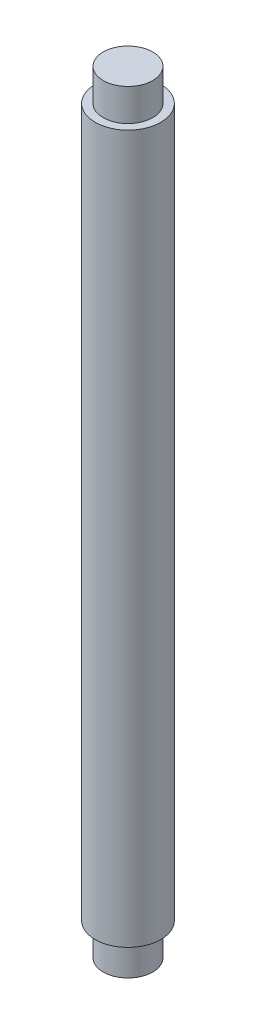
ISO-10303-21;
HEADER;
FILE_DESCRIPTION(('STEP AP214'),'2;1');
FILE_NAME('part.step','',(''),(''),'','','');
FILE_SCHEMA(('AUTOMOTIVE_DESIGN { 1 0 10303 214 1 1 1 1 }'));
ENDSEC;
DATA;
#1=APPLICATION_CONTEXT('core data for automotive mechanical design processes');
#2=APPLICATION_PROTOCOL_DEFINITION('international standard','automotive_design',2000,#1);
#3=PRODUCT_CONTEXT('',#1,'mechanical');
#4=PRODUCT('Part','Part','',(#3));
#5=PRODUCT_RELATED_PRODUCT_CATEGORY('part','',(#4));
#6=PRODUCT_DEFINITION_FORMATION('','',#4);
#7=PRODUCT_DEFINITION_CONTEXT('part definition',#1,'design');
#8=PRODUCT_DEFINITION('design','',#6,#7);
#9=PRODUCT_DEFINITION_SHAPE('','',#8);
#10=(LENGTH_UNIT() NAMED_UNIT(*) SI_UNIT(.MILLI.,.METRE.));
#11=(NAMED_UNIT(*) PLANE_ANGLE_UNIT() SI_UNIT($,.RADIAN.));
#12=(NAMED_UNIT(*) SI_UNIT($,.STERADIAN.) SOLID_ANGLE_UNIT());
#13=UNCERTAINTY_MEASURE_WITH_UNIT(LENGTH_MEASURE(1.E-05),#10,'distance_accuracy_value','');
#14=(GEOMETRIC_REPRESENTATION_CONTEXT(3) GLOBAL_UNCERTAINTY_ASSIGNED_CONTEXT((#13)) GLOBAL_UNIT_ASSIGNED_CONTEXT((#10,
#11,#12)) REPRESENTATION_CONTEXT('',''));
#15=CARTESIAN_POINT('',(0.,0.,0.));
#16=DIRECTION('',(0.,0.,1.));
#17=DIRECTION('',(1.,0.,0.));
#18=AXIS2_PLACEMENT_3D('',#15,#16,#17);
#19=CARTESIAN_POINT('',(-7.23899999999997,-7.11200000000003,0.));
#20=DIRECTION('',(0.,1.,0.));
#21=DIRECTION('',(0.,0.,1.));
#22=AXIS2_PLACEMENT_3D('',#19,#20,#21);
#23=CYLINDRICAL_SURFACE('',#22,9.77899999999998);
#24=CARTESIAN_POINT('',(-7.23899999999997,-7.11200000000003,0.));
#25=DIRECTION('',(0.,1.,0.));
#26=DIRECTION('',(0.,0.,1.));
#27=AXIS2_PLACEMENT_3D('',#24,#25,#26);
#28=CIRCLE('',#27,9.779);
#29=CARTESIAN_POINT('',(-7.23899999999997,-7.11200000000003,9.779));
#30=VERTEX_POINT('',#29);
#31=EDGE_CURVE('E10',#30,#30,#28,.T.);
#32=ORIENTED_EDGE('',*,*,#31,.T.);
#33=EDGE_LOOP('',(#32));
#34=FACE_BOUND('',#33,.T.);
#35=CARTESIAN_POINT('',(-7.23899999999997,5.588,0.));
#36=DIRECTION('',(0.,1.,0.));
#37=DIRECTION('',(0.,0.,1.));
#38=AXIS2_PLACEMENT_3D('',#35,#36,#37);
#39=CIRCLE('',#38,9.77899999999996);
#40=CARTESIAN_POINT('',(-7.23899999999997,5.588,9.77899999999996));
#41=VERTEX_POINT('',#40);
#42=EDGE_CURVE('E51',#41,#41,#39,.T.);
#43=ORIENTED_EDGE('',*,*,#42,.F.);
#44=EDGE_LOOP('',(#43));
#45=FACE_BOUND('',#44,.T.);
#46=ADVANCED_FACE('F29',(#34,#45),#23,.T.);
#47=CARTESIAN_POINT('',(2.54000000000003,-7.11200000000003,0.));
#48=DIRECTION('',(0.,-1.,0.));
#49=DIRECTION('',(0.,0.,-1.));
#50=AXIS2_PLACEMENT_3D('',#47,#48,#49);
#51=PLANE('',#50);
#52=ORIENTED_EDGE('',*,*,#31,.F.);
#53=EDGE_LOOP('',(#52));
#54=FACE_BOUND('',#53,.T.);
#55=ADVANCED_FACE('F59',(#54),#51,.T.);
#56=CARTESIAN_POINT('',(-7.23899999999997,297.688,0.));
#57=DIRECTION('',(0.,1.,0.));
#58=DIRECTION('',(0.,0.,1.));
#59=AXIS2_PLACEMENT_3D('',#56,#57,#58);
#60=PLANE('',#59);
#61=CARTESIAN_POINT('',(-7.23899999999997,297.688,0.));
#62=DIRECTION('',(0.,1.,0.));
#63=DIRECTION('',(0.,0.,1.));
#64=AXIS2_PLACEMENT_3D('',#61,#62,#63);
#65=CIRCLE('',#64,9.779);
#66=CARTESIAN_POINT('',(-7.23899999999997,297.688,9.779));
#67=VERTEX_POINT('',#66);
#68=EDGE_CURVE('E35',#67,#67,#65,.T.);
#69=ORIENTED_EDGE('',*,*,#68,.T.);
#70=EDGE_LOOP('',(#69));
#71=FACE_BOUND('',#70,.T.);
#72=ADVANCED_FACE('F63',(#71),#60,.T.);
#73=CARTESIAN_POINT('',(-7.23899999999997,-7.11200000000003,0.));
#74=DIRECTION('',(0.,1.,0.));
#75=DIRECTION('',(0.,0.,1.));
#76=AXIS2_PLACEMENT_3D('',#73,#74,#75);
#77=CYLINDRICAL_SURFACE('',#76,9.779);
#78=CARTESIAN_POINT('',(-7.23899999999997,284.988,0.));
#79=DIRECTION('',(0.,1.,0.));
#80=DIRECTION('',(0.,0.,1.));
#81=AXIS2_PLACEMENT_3D('',#78,#79,#80);
#82=CIRCLE('',#81,9.779);
#83=CARTESIAN_POINT('',(-7.23899999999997,284.988,9.779));
#84=VERTEX_POINT('',#83);
#85=EDGE_CURVE('E39',#84,#84,#82,.T.);
#86=ORIENTED_EDGE('',*,*,#85,.T.);
#87=EDGE_LOOP('',(#86));
#88=FACE_BOUND('',#87,.T.);
#89=ORIENTED_EDGE('',*,*,#68,.F.);
#90=EDGE_LOOP('',(#89));
#91=FACE_BOUND('',#90,.T.);
#92=ADVANCED_FACE('F68',(#88,#91),#77,.T.);
#93=CARTESIAN_POINT('',(2.54000000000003,284.988,0.));
#94=DIRECTION('',(0.,1.,0.));
#95=DIRECTION('',(0.,0.,1.));
#96=AXIS2_PLACEMENT_3D('',#93,#94,#95);
#97=PLANE('',#96);
#98=CARTESIAN_POINT('',(-7.23899999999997,284.988,0.));
#99=DIRECTION('',(0.,1.,0.));
#100=DIRECTION('',(0.,0.,1.));
#101=AXIS2_PLACEMENT_3D('',#98,#99,#100);
#102=CIRCLE('',#101,12.954);
#103=CARTESIAN_POINT('',(-7.23899999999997,284.988,12.954));
#104=VERTEX_POINT('',#103);
#105=EDGE_CURVE('E43',#104,#104,#102,.T.);
#106=ORIENTED_EDGE('',*,*,#105,.T.);
#107=EDGE_LOOP('',(#106));
#108=FACE_BOUND('',#107,.T.);
#109=ORIENTED_EDGE('',*,*,#85,.F.);
#110=EDGE_LOOP('',(#109));
#111=FACE_BOUND('',#110,.T.);
#112=ADVANCED_FACE('F73',(#108,#111),#97,.T.);
#113=CARTESIAN_POINT('',(-7.23899999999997,-7.11200000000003,0.));
#114=DIRECTION('',(0.,1.,0.));
#115=DIRECTION('',(0.,0.,1.));
#116=AXIS2_PLACEMENT_3D('',#113,#114,#115);
#117=CYLINDRICAL_SURFACE('',#116,12.954);
#118=CARTESIAN_POINT('',(-7.23899999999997,5.58799999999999,0.));
#119=DIRECTION('',(0.,1.,0.));
#120=DIRECTION('',(0.,0.,1.));
#121=AXIS2_PLACEMENT_3D('',#118,#119,#120);
#122=CIRCLE('',#121,12.954);
#123=CARTESIAN_POINT('',(-7.23899999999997,5.58799999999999,12.954));
#124=VERTEX_POINT('',#123);
#125=EDGE_CURVE('E48',#124,#124,#122,.T.);
#126=ORIENTED_EDGE('',*,*,#125,.T.);
#127=EDGE_LOOP('',(#126));
#128=FACE_BOUND('',#127,.T.);
#129=ORIENTED_EDGE('',*,*,#105,.F.);
#130=EDGE_LOOP('',(#129));
#131=FACE_BOUND('',#130,.T.);
#132=ADVANCED_FACE('F77',(#128,#131),#117,.T.);
#133=CARTESIAN_POINT('',(5.715,5.588,0.));
#134=DIRECTION('',(0.,-1.,0.));
#135=DIRECTION('',(0.,0.,-1.));
#136=AXIS2_PLACEMENT_3D('',#133,#134,#135);
#137=PLANE('',#136);
#138=ORIENTED_EDGE('',*,*,#42,.T.);
#139=EDGE_LOOP('',(#138));
#140=FACE_BOUND('',#139,.T.);
#141=ORIENTED_EDGE('',*,*,#125,.F.);
#142=EDGE_LOOP('',(#141));
#143=FACE_BOUND('',#142,.T.);
#144=ADVANCED_FACE('F55',(#140,#143),#137,.T.);
#145=CLOSED_SHELL('',(#46,#55,#72,#92,#112,#132,#144));
#146=MANIFOLD_SOLID_BREP('B2',#145);
#147=ADVANCED_BREP_SHAPE_REPRESENTATION('',(#18,#146),#14);
#148=SHAPE_DEFINITION_REPRESENTATION(#9,#147);
ENDSEC;
END-ISO-10303-21;
